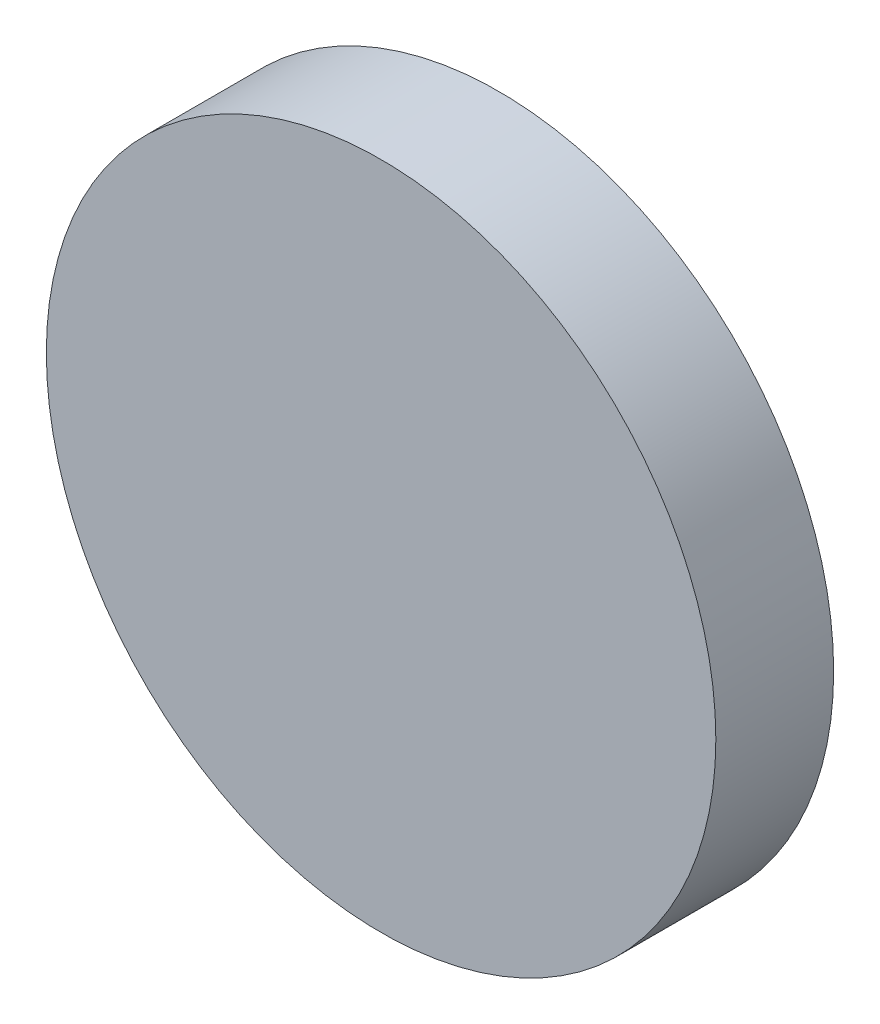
from build123d import *

# Parameters (mm, degrees)
SKETCH1_R           = 63.5
BOSS_EXTRUDE1_DEPTH = 22.352
SKETCH2_R           = 19.05
BOSS_EXTRUDE2_DEPTH = 12.7


with BuildPart() as part:
    # Sketch1 → Boss-Extrude1 (new body)
    with BuildSketch(Plane.XY):
        Circle(SKETCH1_R)
    extrude(amount=BOSS_EXTRUDE1_DEPTH)

    # Sketch2 → Boss-Extrude2 (add)
    with BuildSketch(Plane.XY):
        Circle(SKETCH2_R)
    extrude(amount=BOSS_EXTRUDE2_DEPTH)


solid = part.part
